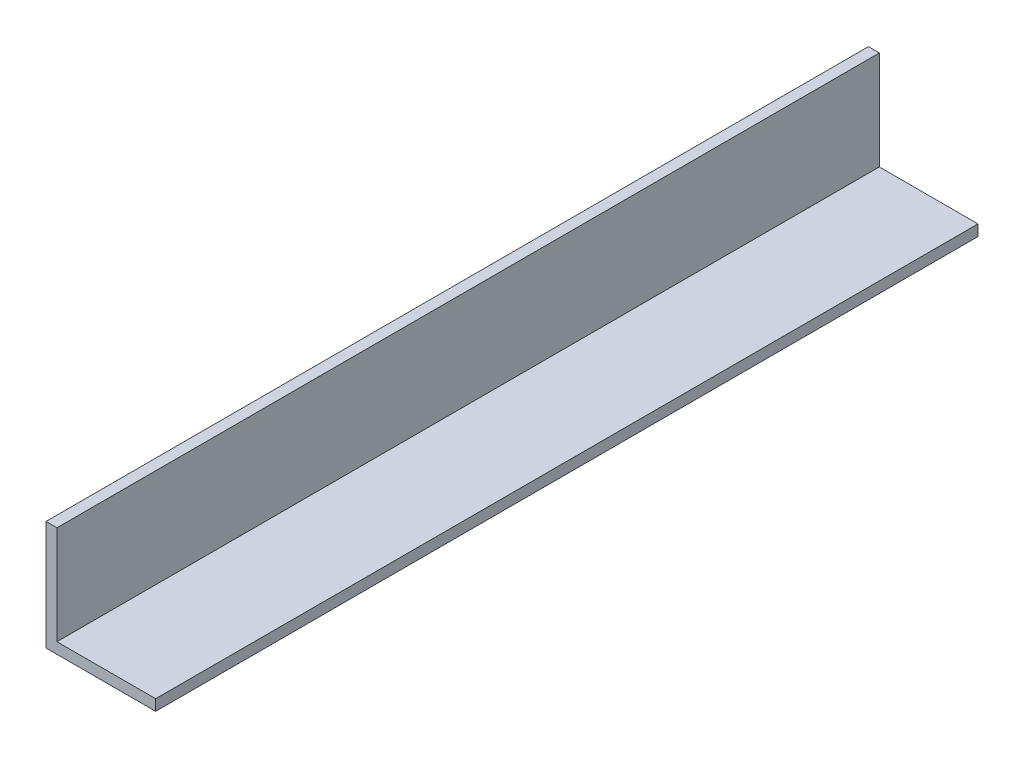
ISO-10303-21;
HEADER;
FILE_DESCRIPTION(('STEP AP214'),'2;1');
FILE_NAME('part.step','',(''),(''),'','','');
FILE_SCHEMA(('AUTOMOTIVE_DESIGN { 1 0 10303 214 1 1 1 1 }'));
ENDSEC;
DATA;
#1=APPLICATION_CONTEXT('core data for automotive mechanical design processes');
#2=APPLICATION_PROTOCOL_DEFINITION('international standard','automotive_design',2000,#1);
#3=PRODUCT_CONTEXT('',#1,'mechanical');
#4=PRODUCT('Part','Part','',(#3));
#5=PRODUCT_RELATED_PRODUCT_CATEGORY('part','',(#4));
#6=PRODUCT_DEFINITION_FORMATION('','',#4);
#7=PRODUCT_DEFINITION_CONTEXT('part definition',#1,'design');
#8=PRODUCT_DEFINITION('design','',#6,#7);
#9=PRODUCT_DEFINITION_SHAPE('','',#8);
#10=(LENGTH_UNIT() NAMED_UNIT(*) SI_UNIT(.MILLI.,.METRE.));
#11=(NAMED_UNIT(*) PLANE_ANGLE_UNIT() SI_UNIT($,.RADIAN.));
#12=(NAMED_UNIT(*) SI_UNIT($,.STERADIAN.) SOLID_ANGLE_UNIT());
#13=UNCERTAINTY_MEASURE_WITH_UNIT(LENGTH_MEASURE(1.E-05),#10,'distance_accuracy_value','');
#14=(GEOMETRIC_REPRESENTATION_CONTEXT(3) GLOBAL_UNCERTAINTY_ASSIGNED_CONTEXT((#13)) GLOBAL_UNIT_ASSIGNED_CONTEXT((#10,
#11,#12)) REPRESENTATION_CONTEXT('',''));
#15=CARTESIAN_POINT('',(0.,0.,0.));
#16=DIRECTION('',(0.,0.,1.));
#17=DIRECTION('',(1.,0.,0.));
#18=AXIS2_PLACEMENT_3D('',#15,#16,#17);
#19=CARTESIAN_POINT('',(36.,0.,150.));
#20=DIRECTION('',(0.,-1.,0.));
#21=DIRECTION('',(1.,0.,0.));
#22=AXIS2_PLACEMENT_3D('',#19,#20,#21);
#23=PLANE('',#22);
#24=DIRECTION('',(-1.,0.,0.));
#25=VECTOR('',#24,1.);
#26=CARTESIAN_POINT('',(36.,0.,-150.));
#27=LINE('',#26,#25);
#28=CARTESIAN_POINT('',(36.,0.,-150.));
#29=VERTEX_POINT('',#28);
#30=CARTESIAN_POINT('',(0.,0.,-150.));
#31=VERTEX_POINT('',#30);
#32=EDGE_CURVE('E120',#29,#31,#27,.T.);
#33=ORIENTED_EDGE('',*,*,#32,.T.);
#34=DIRECTION('',(0.,0.,-1.));
#35=VECTOR('',#34,1.);
#36=CARTESIAN_POINT('',(0.,0.,150.));
#37=LINE('',#36,#35);
#38=CARTESIAN_POINT('',(0.,0.,150.));
#39=VERTEX_POINT('',#38);
#40=EDGE_CURVE('E11',#39,#31,#37,.T.);
#41=ORIENTED_EDGE('',*,*,#40,.F.);
#42=DIRECTION('',(-1.,0.,0.));
#43=VECTOR('',#42,1.);
#44=CARTESIAN_POINT('',(36.,0.,150.));
#45=LINE('',#44,#43);
#46=CARTESIAN_POINT('',(36.,0.,150.));
#47=VERTEX_POINT('',#46);
#48=EDGE_CURVE('E130',#47,#39,#45,.T.);
#49=ORIENTED_EDGE('',*,*,#48,.F.);
#50=DIRECTION('',(0.,0.,-1.));
#51=VECTOR('',#50,1.);
#52=CARTESIAN_POINT('',(36.,0.,150.));
#53=LINE('',#52,#51);
#54=EDGE_CURVE('E116',#47,#29,#53,.T.);
#55=ORIENTED_EDGE('',*,*,#54,.T.);
#56=EDGE_LOOP('',(#33,#41,#49,#55));
#57=FACE_BOUND('',#56,.T.);
#58=ADVANCED_FACE('F36',(#57),#23,.F.);
#59=CARTESIAN_POINT('',(0.,0.,150.));
#60=DIRECTION('',(-1.,0.,0.));
#61=DIRECTION('',(0.,0.,1.));
#62=AXIS2_PLACEMENT_3D('',#59,#60,#61);
#63=PLANE('',#62);
#64=DIRECTION('',(0.,1.,0.));
#65=VECTOR('',#64,1.);
#66=CARTESIAN_POINT('',(0.,0.,-150.));
#67=LINE('',#66,#65);
#68=CARTESIAN_POINT('',(0.,36.,-150.));
#69=VERTEX_POINT('',#68);
#70=EDGE_CURVE('E123',#31,#69,#67,.T.);
#71=ORIENTED_EDGE('',*,*,#70,.T.);
#72=DIRECTION('',(0.,0.,-1.));
#73=VECTOR('',#72,1.);
#74=CARTESIAN_POINT('',(0.,36.,150.));
#75=LINE('',#74,#73);
#76=CARTESIAN_POINT('',(0.,36.,150.));
#77=VERTEX_POINT('',#76);
#78=EDGE_CURVE('E44',#77,#69,#75,.T.);
#79=ORIENTED_EDGE('',*,*,#78,.F.);
#80=DIRECTION('',(0.,1.,0.));
#81=VECTOR('',#80,1.);
#82=CARTESIAN_POINT('',(0.,0.,150.));
#83=LINE('',#82,#81);
#84=EDGE_CURVE('E89',#39,#77,#83,.T.);
#85=ORIENTED_EDGE('',*,*,#84,.F.);
#86=ORIENTED_EDGE('',*,*,#40,.T.);
#87=EDGE_LOOP('',(#71,#79,#85,#86));
#88=FACE_BOUND('',#87,.T.);
#89=ADVANCED_FACE('F154',(#88),#63,.F.);
#90=CARTESIAN_POINT('',(0.,36.,150.));
#91=DIRECTION('',(0.,-1.,0.));
#92=DIRECTION('',(0.,0.,-1.));
#93=AXIS2_PLACEMENT_3D('',#90,#91,#92);
#94=PLANE('',#93);
#95=DIRECTION('',(-1.,0.,0.));
#96=VECTOR('',#95,1.);
#97=CARTESIAN_POINT('',(0.,36.,-150.));
#98=LINE('',#97,#96);
#99=CARTESIAN_POINT('',(-4.,36.,-150.));
#100=VERTEX_POINT('',#99);
#101=EDGE_CURVE('E125',#69,#100,#98,.T.);
#102=ORIENTED_EDGE('',*,*,#101,.T.);
#103=DIRECTION('',(0.,0.,-1.));
#104=VECTOR('',#103,1.);
#105=CARTESIAN_POINT('',(-4.,36.,150.));
#106=LINE('',#105,#104);
#107=CARTESIAN_POINT('',(-4.,36.,150.));
#108=VERTEX_POINT('',#107);
#109=EDGE_CURVE('E111',#108,#100,#106,.T.);
#110=ORIENTED_EDGE('',*,*,#109,.F.);
#111=DIRECTION('',(-1.,0.,0.));
#112=VECTOR('',#111,1.);
#113=CARTESIAN_POINT('',(0.,36.,150.));
#114=LINE('',#113,#112);
#115=EDGE_CURVE('E102',#77,#108,#114,.T.);
#116=ORIENTED_EDGE('',*,*,#115,.F.);
#117=ORIENTED_EDGE('',*,*,#78,.T.);
#118=EDGE_LOOP('',(#102,#110,#116,#117));
#119=FACE_BOUND('',#118,.T.);
#120=ADVANCED_FACE('F136',(#119),#94,.F.);
#121=CARTESIAN_POINT('',(-4.,36.,150.));
#122=DIRECTION('',(1.,0.,0.));
#123=DIRECTION('',(0.,1.,0.));
#124=AXIS2_PLACEMENT_3D('',#121,#122,#123);
#125=PLANE('',#124);
#126=DIRECTION('',(0.,-1.,0.));
#127=VECTOR('',#126,1.);
#128=CARTESIAN_POINT('',(-4.,36.,-150.));
#129=LINE('',#128,#127);
#130=CARTESIAN_POINT('',(-3.99999999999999,-4.,-150.));
#131=VERTEX_POINT('',#130);
#132=EDGE_CURVE('E110',#100,#131,#129,.T.);
#133=ORIENTED_EDGE('',*,*,#132,.T.);
#134=DIRECTION('',(0.,0.,-1.));
#135=VECTOR('',#134,1.);
#136=CARTESIAN_POINT('',(-3.99999999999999,-4.,150.));
#137=LINE('',#136,#135);
#138=CARTESIAN_POINT('',(-3.99999999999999,-4.,150.));
#139=VERTEX_POINT('',#138);
#140=EDGE_CURVE('E107',#139,#131,#137,.T.);
#141=ORIENTED_EDGE('',*,*,#140,.F.);
#142=DIRECTION('',(0.,-1.,0.));
#143=VECTOR('',#142,1.);
#144=CARTESIAN_POINT('',(-4.,36.,150.));
#145=LINE('',#144,#143);
#146=EDGE_CURVE('E96',#108,#139,#145,.T.);
#147=ORIENTED_EDGE('',*,*,#146,.F.);
#148=ORIENTED_EDGE('',*,*,#109,.T.);
#149=EDGE_LOOP('',(#133,#141,#147,#148));
#150=FACE_BOUND('',#149,.T.);
#151=ADVANCED_FACE('F108',(#150),#125,.F.);
#152=CARTESIAN_POINT('',(-3.99999999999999,-4.,150.));
#153=DIRECTION('',(0.,1.,0.));
#154=DIRECTION('',(0.,0.,1.));
#155=AXIS2_PLACEMENT_3D('',#152,#153,#154);
#156=PLANE('',#155);
#157=DIRECTION('',(1.,0.,0.));
#158=VECTOR('',#157,1.);
#159=CARTESIAN_POINT('',(-3.99999999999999,-4.,-150.));
#160=LINE('',#159,#158);
#161=CARTESIAN_POINT('',(36.,-4.,-150.));
#162=VERTEX_POINT('',#161);
#163=EDGE_CURVE('E75',#131,#162,#160,.T.);
#164=ORIENTED_EDGE('',*,*,#163,.T.);
#165=DIRECTION('',(0.,0.,-1.));
#166=VECTOR('',#165,1.);
#167=CARTESIAN_POINT('',(36.,-4.,150.));
#168=LINE('',#167,#166);
#169=CARTESIAN_POINT('',(36.,-4.,150.));
#170=VERTEX_POINT('',#169);
#171=EDGE_CURVE('E112',#170,#162,#168,.T.);
#172=ORIENTED_EDGE('',*,*,#171,.F.);
#173=DIRECTION('',(1.,0.,0.));
#174=VECTOR('',#173,1.);
#175=CARTESIAN_POINT('',(-3.99999999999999,-4.,150.));
#176=LINE('',#175,#174);
#177=EDGE_CURVE('E100',#139,#170,#176,.T.);
#178=ORIENTED_EDGE('',*,*,#177,.F.);
#179=ORIENTED_EDGE('',*,*,#140,.T.);
#180=EDGE_LOOP('',(#164,#172,#178,#179));
#181=FACE_BOUND('',#180,.T.);
#182=ADVANCED_FACE('F114',(#181),#156,.F.);
#183=CARTESIAN_POINT('',(36.,-4.,150.));
#184=DIRECTION('',(-1.,0.,0.));
#185=DIRECTION('',(0.,0.,1.));
#186=AXIS2_PLACEMENT_3D('',#183,#184,#185);
#187=PLANE('',#186);
#188=DIRECTION('',(0.,1.,0.));
#189=VECTOR('',#188,1.);
#190=CARTESIAN_POINT('',(36.,-4.,-150.));
#191=LINE('',#190,#189);
#192=EDGE_CURVE('E81',#162,#29,#191,.T.);
#193=ORIENTED_EDGE('',*,*,#192,.T.);
#194=ORIENTED_EDGE('',*,*,#54,.F.);
#195=DIRECTION('',(0.,1.,0.));
#196=VECTOR('',#195,1.);
#197=CARTESIAN_POINT('',(36.,-4.,150.));
#198=LINE('',#197,#196);
#199=EDGE_CURVE('E52',#170,#47,#198,.T.);
#200=ORIENTED_EDGE('',*,*,#199,.F.);
#201=ORIENTED_EDGE('',*,*,#171,.T.);
#202=EDGE_LOOP('',(#193,#194,#200,#201));
#203=FACE_BOUND('',#202,.T.);
#204=ADVANCED_FACE('F143',(#203),#187,.F.);
#205=CARTESIAN_POINT('',(0.,0.,150.));
#206=DIRECTION('',(0.,0.,-1.));
#207=DIRECTION('',(-1.,0.,0.));
#208=AXIS2_PLACEMENT_3D('',#205,#206,#207);
#209=PLANE('',#208);
#210=ORIENTED_EDGE('',*,*,#48,.T.);
#211=ORIENTED_EDGE('',*,*,#84,.T.);
#212=ORIENTED_EDGE('',*,*,#115,.T.);
#213=ORIENTED_EDGE('',*,*,#146,.T.);
#214=ORIENTED_EDGE('',*,*,#177,.T.);
#215=ORIENTED_EDGE('',*,*,#199,.T.);
#216=EDGE_LOOP('',(#210,#211,#212,#213,#214,#215));
#217=FACE_BOUND('',#216,.T.);
#218=ADVANCED_FACE('F98',(#217),#209,.F.);
#219=CARTESIAN_POINT('',(0.,0.,-150.));
#220=DIRECTION('',(0.,0.,-1.));
#221=DIRECTION('',(-1.,0.,0.));
#222=AXIS2_PLACEMENT_3D('',#219,#220,#221);
#223=PLANE('',#222);
#224=ORIENTED_EDGE('',*,*,#32,.F.);
#225=ORIENTED_EDGE('',*,*,#192,.F.);
#226=ORIENTED_EDGE('',*,*,#163,.F.);
#227=ORIENTED_EDGE('',*,*,#132,.F.);
#228=ORIENTED_EDGE('',*,*,#101,.F.);
#229=ORIENTED_EDGE('',*,*,#70,.F.);
#230=EDGE_LOOP('',(#224,#225,#226,#227,#228,#229));
#231=FACE_BOUND('',#230,.T.);
#232=ADVANCED_FACE('F139',(#231),#223,.T.);
#233=CLOSED_SHELL('',(#58,#89,#120,#151,#182,#204,#218,#232));
#234=MANIFOLD_SOLID_BREP('B2',#233);
#235=ADVANCED_BREP_SHAPE_REPRESENTATION('',(#18,#234),#14);
#236=SHAPE_DEFINITION_REPRESENTATION(#9,#235);
ENDSEC;
END-ISO-10303-21;
